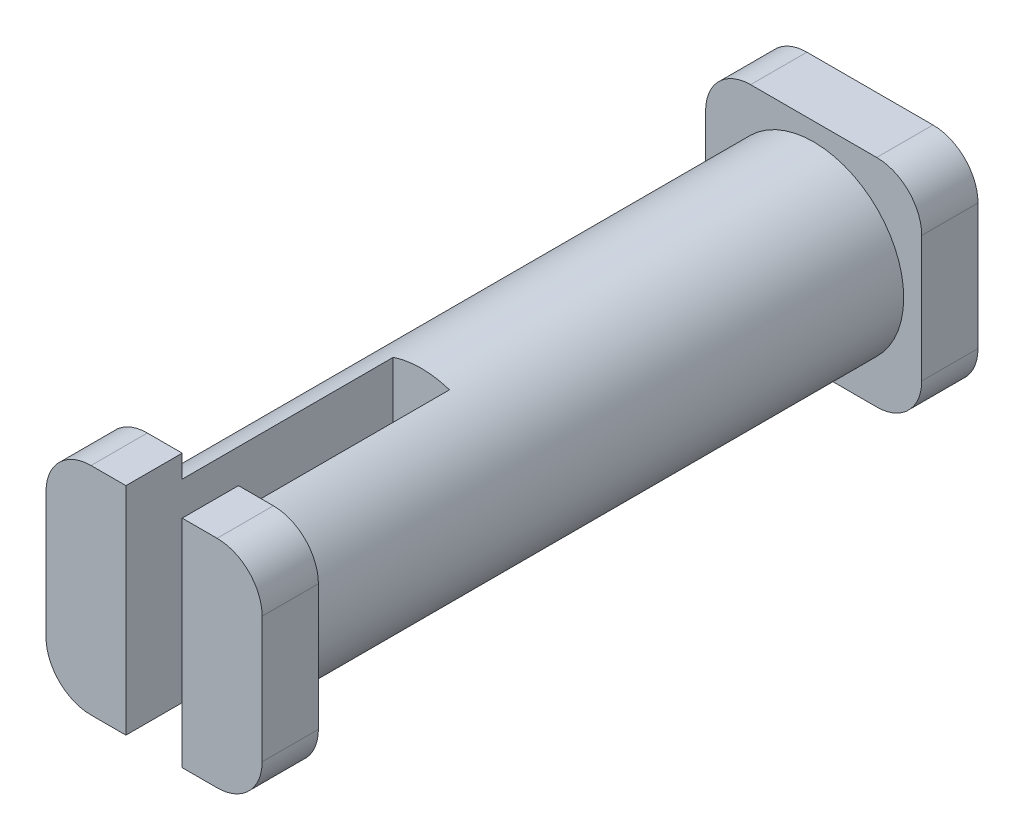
from build123d import *

# Parameters (mm, degrees)
BOSS_EXTRUDE1_DEPTH = 1.5875
SKETCH2_R           = 2.54
BOSS_EXTRUDE2_DEPTH = 17.018
SKETCH3_W           = 1.5875
SKETCH3_H           = 6.096
CUT_EXTRUDE1_DEPTH  = 7.540625


with BuildPart() as part:
    # Sketch1 → Boss-Extrude1 (new body)
    with BuildSketch(Plane.XY):
        with BuildLine():
            Line((1.27, 0), (4.826, 0))
            ThreePointArc((4.826, 0), (5.724025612, 0.371974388), (6.096, 1.27))
            Line((6.096, 1.27), (6.096, 4.826))
            ThreePointArc((6.096, 4.826), (5.724025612, 5.724025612), (4.826, 6.096))
            Line((4.826, 6.096), (1.27, 6.096))
            ThreePointArc((1.27, 6.096), (0.371974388, 5.724025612), (0, 4.826))
            Line((0, 4.826), (0, 1.27))
            ThreePointArc((0, 1.27), (0.371974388, 0.371974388), (1.27, 0))
        make_face()
    boss_extrude1 = extrude(amount=BOSS_EXTRUDE1_DEPTH)

    # Sketch2 → Boss-Extrude2 (add)
    with BuildSketch(Plane.XY.offset(1.5875)):
        with Locations((3.048, 3.048)):
            Circle(SKETCH2_R)
    extrude(amount=BOSS_EXTRUDE2_DEPTH)

    # Mirror1: Boss-Extrude1 across plane
    add(boss_extrude1.mirror(Plane.XY.offset(10.0965)))

    # Sketch3 → Cut-Extrude1 (cut)
    with BuildSketch(Plane.XY.offset(20.193)):
        with Locations((3.048, 3.048)):
            Rectangle(SKETCH3_W, SKETCH3_H)
    extrude(amount=-CUT_EXTRUDE1_DEPTH, mode=Mode.SUBTRACT)


solid = part.part
